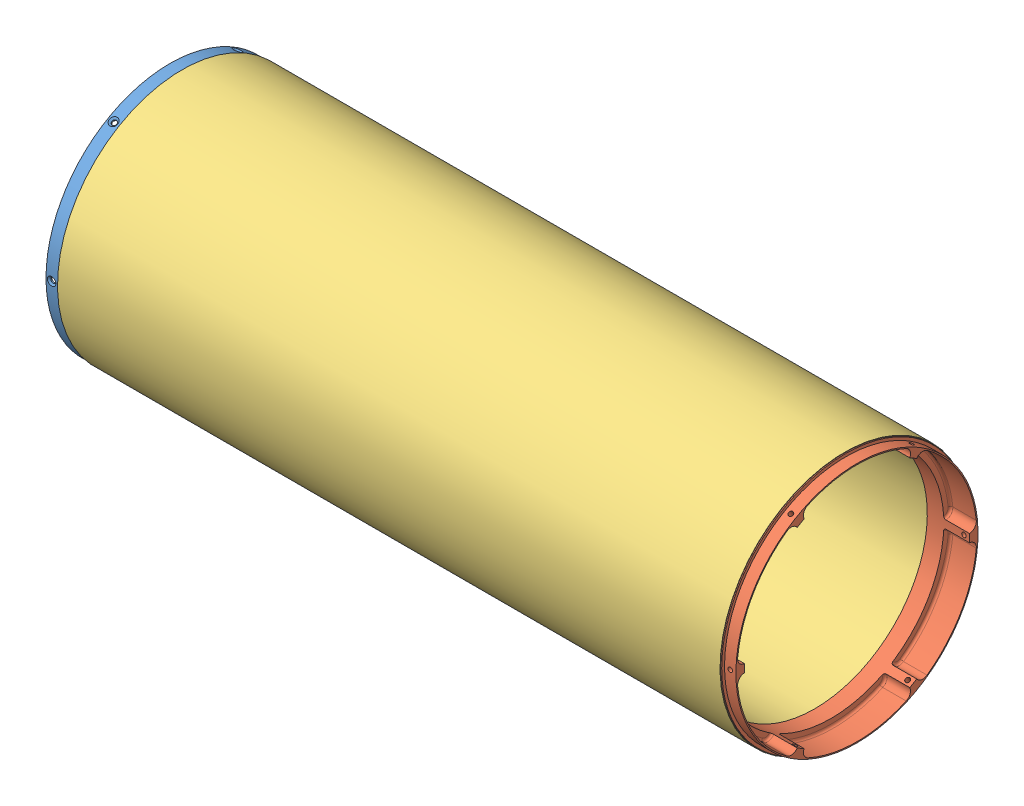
SolidWorks assembly Module_ASSY.SLDASM, configuration Default (file format 7000). Lengths in mm.
Overall size (464.74 168.71 168.71).
3 component instances, 3 part files, 3 mates.
Components (placement in the parent):
- FCR 6in 4_6_14 Final-1: FCR 6in 4_6_14 Final.SLDPRT [Default] at (-116.2362 13.979 -27.9128) size (28.7 167.64 167.64)
- MCR 6in 4_6_14 Final-1: MCR 6in 4_6_14 Final.SLDPRT [Default] at (312.2618 13.979 -27.9128) x (-1 0 0) z (0 -1 0) size (28.63 167.64 167.64)
- Carbon Sleeve-1: Carbon Sleeve.SLDPRT [Default] at (-115.5504 13.979 48.2872) size (448.13 168.71 168.71)
Mates (geometry in assembly coordinates):
- Coincident3: coincident anti-aligned: line of FCR 6in 4_6_14 Final-1 through (-107.9177 16.6971 -27.8643) axis (-1 0 0); line of MCR 6in 4_6_14 Final-1 through (325.0253 16.6971 -27.8643) axis (1 0 0)
- Coincident4: coincident anti-aligned: plane of MCR 6in 4_6_14 Final-1 through (322.4218 13.979 -35.1518) normal (-1 0 0); plane of Carbon Sleeve-1 through (322.4218 13.979 48.2872) normal (1 0 0)
- Concentric1: concentric anti-aligned: cylinder of MCR 6in 4_6_14 Final-1 through (356.5717 13.979 48.2872) axis (1 0 0) radius 83.439; cylinder of Carbon Sleeve-1 through (-115.5504 13.979 48.2872) axis (-1 0 0) radius 84.3534
